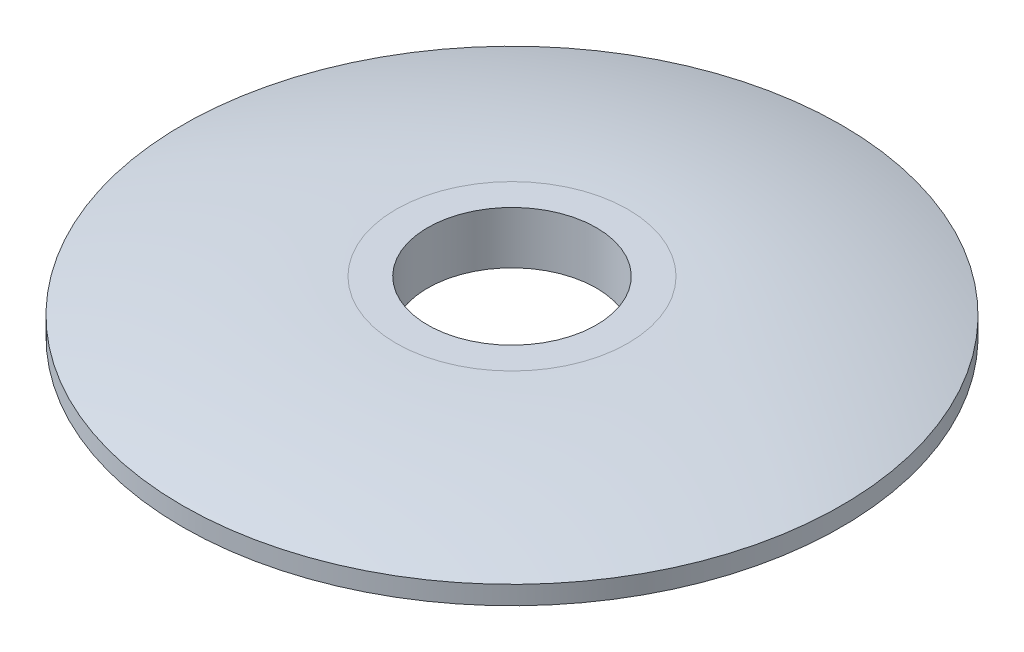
from build123d import *


with BuildPart() as part:
    # Sketch1 → Revolve1 (revolve)
    with BuildSketch(Plane.XY, mode=Mode.PRIVATE) as revolve1_sk:
        with BuildLine():
            Line((31.25, 0), (31.25, 1.759391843))
            ThreePointArc((31.25, 1.759391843), (21.250712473, 4.155148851), (11, 4.96031746))
            Line((11, 4.96031746), (8, 4.96031746))
            Line((8, 4.96031746), (8, 0))
            Line((8, 0), (31.25, 0))
        make_face()
    revolve(revolve1_sk.sketch.rotate(Axis((0, 0, 0), (0, 1, 0)), 90), axis=Axis((0, 0, 0), (0, 1, 0)))


solid = part.part
